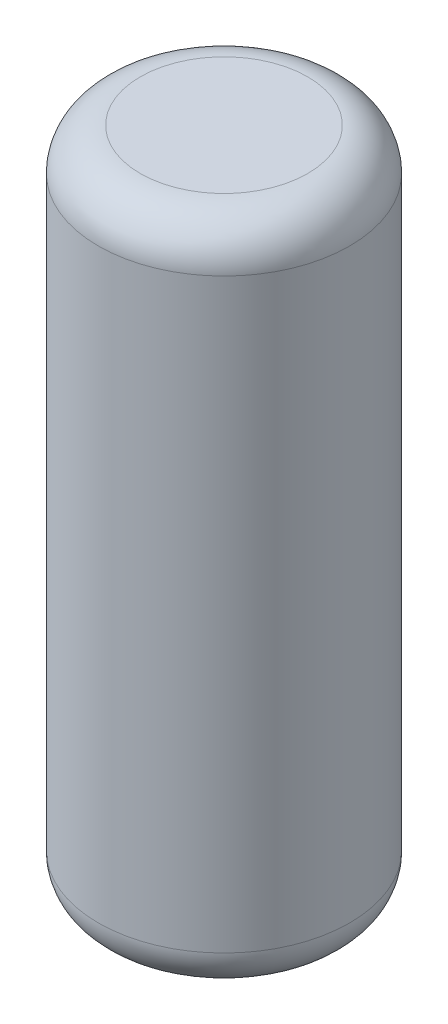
from build123d import *

# Parameters (mm, degrees)
SKETCH1_R           = 1.5
BOSS_EXTRUDE1_DEPTH = 8
FILLET1_R           = 0.5


with BuildPart() as part:
    # Sketch1 → Boss-Extrude1 (new body)
    with BuildSketch(Plane(origin=(0, 0, 0), x_dir=(1, 0, 0), z_dir=(0, 1, 0))):
        with Locations(Location((0, 0, 0), (0, 0, 270))):
            Circle(SKETCH1_R)
    extrude(amount=BOSS_EXTRUDE1_DEPTH)

    # Fillet1
    fillet1_edges = [part.edges().sort_by_distance(p)[0] for p in [
        (0, 0, -1.5),
        (0, 8, -1.5),
    ]]
    fillet(fillet1_edges, radius=FILLET1_R)


solid = part.part
